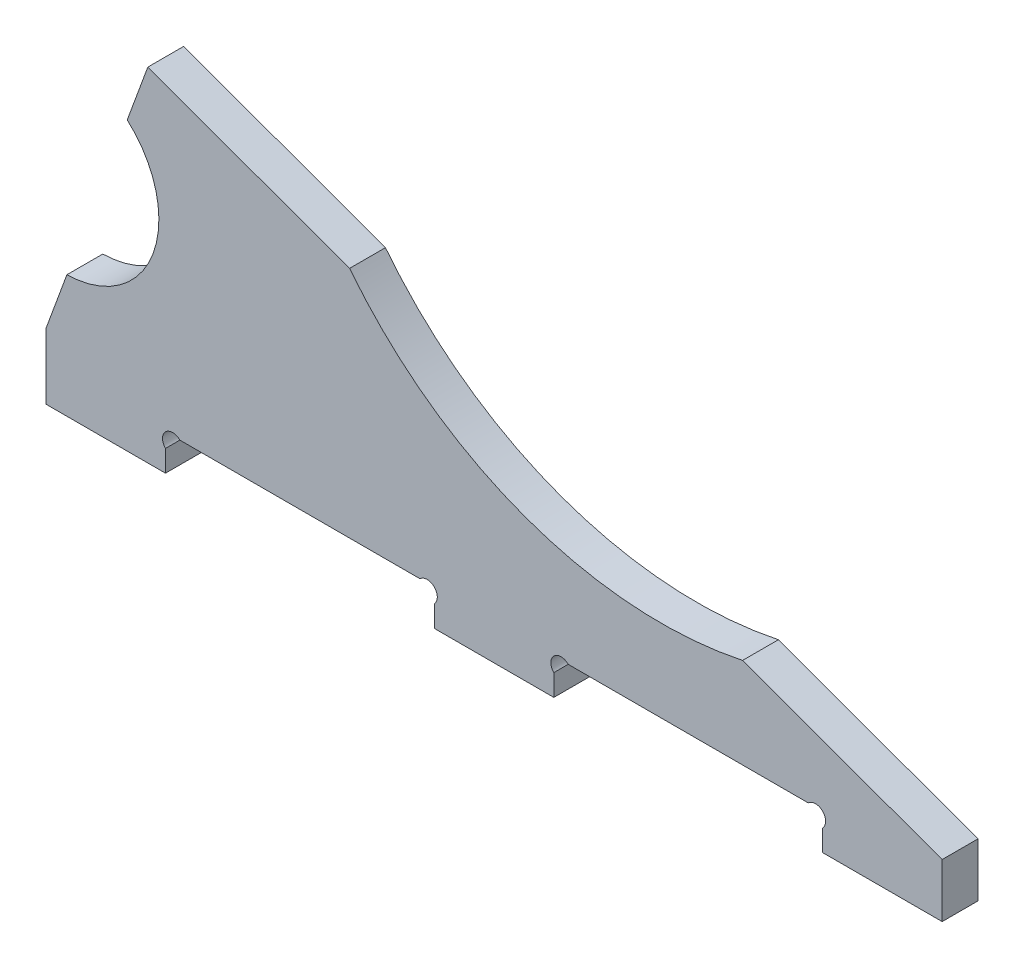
from build123d import *

# Parameters (mm, degrees)
EXTRUSION1_DEPTH = 6


with BuildPart() as part:
    # Esquisse1 → Extrusion1 (new body)
    with BuildSketch(Plane.XY):
        with BuildLine():
            Line((0, 0), (20, 0))
            Line((20, 0), (20, 3.595836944))
            ThreePointArc((20, 3.595836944), (20, 6), (22.404163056, 6))
            Line((22.404163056, 6), (62.595836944, 6))
            ThreePointArc((62.595836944, 6), (65, 6), (65, 3.595836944))
            Line((65, 3.595836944), (65, 0))
            Line((65, 0), (85, 0))
            Line((85, 0), (85, 3.595836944))
            ThreePointArc((85, 3.595836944), (85, 6), (87.404163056, 6))
            Line((87.404163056, 6), (127.595836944, 6))
            ThreePointArc((127.595836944, 6), (130, 6), (130, 3.595836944))
            Line((130, 3.595836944), (130, 0))
            Line((130, 0), (150, 0))
            Line((150, 0), (150, 9))
            Line((150, 9), (116.592002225, 21.159516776))
            ThreePointArc((116.592002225, 21.159516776), (80.282559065, 23.733295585), (50.81351877, 45.100926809))
            Line((50.81351877, 45.100926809), (17.042415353, 57.392603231))
            Line((17.042415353, 57.392603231), (13.594183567, 48.005879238))
            ThreePointArc((13.594183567, 48.005879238), (17.932561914, 30.815246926), (3.497575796, 20.521047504))
            Line((3.497575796, 20.521047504), (0, 11))
            Line((0, 11), (0, 0))
        make_face()
    extrude(amount=EXTRUSION1_DEPTH)


solid = part.part
